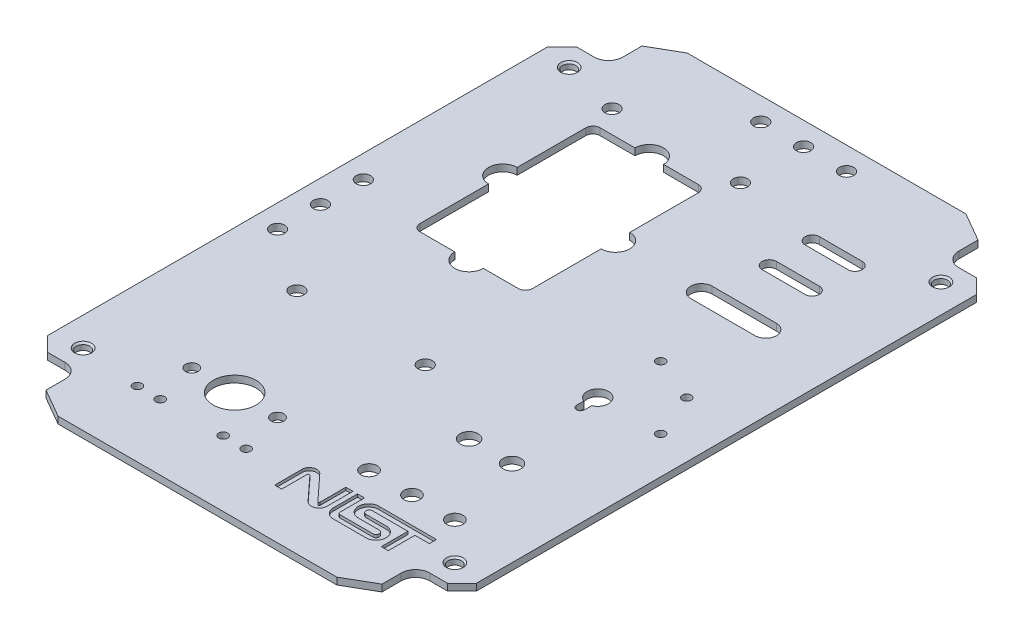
from build123d import *

# Parameters (mm, degrees)
BOSS_EXTRUDE1_DEPTH              = 3.03784
F_15_64_0_23438_DIAMETER_HOLE1_D = 5.9436
LPATTERN1_COUNT                  = 2
LPATTERN1_PITCH                  = 165.1
LPATTERN1_COUNT_DIR2             = 2
LPATTERN1_PITCH_DIR2             = 215.9
FILLET1_R                        = 6.35
F_1_4_0_25_DIAMETER_HOLE2_D      = 6.35
LPATTERN2_COUNT                  = 3
LPATTERN2_PITCH                  = 19.05
F_1_4_0_25_DIAMETER_HOLE3_D      = 6.35
LPATTERN3_COUNT                  = 2
LPATTERN3_PITCH                  = 139.99972
LPATTERN3_COUNT_DIR2             = 2
LPATTERN3_PITCH_DIR2             = 56.999886
CUT_EXTRUDE1_DEPTH               = 170.109080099
CHAMFER1_SIZE                    = 0.762
CHAMFER2_SIZE                    = 6.35
CHAMFER3_SIZE                    = 12.7
CHAMFER3_SIZE2                   = 7.332348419
CHAMFER4_SIZE                    = 12.7
CHAMFER4_SIZE2                   = 7.332348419
F_2_0_221_DIAMETER_HOLE1_D       = 5.6134
LPATTERN4_COUNT                  = 2
LPATTERN4_PITCH                  = 38.1
F_3_4_0_75_DIAMETER_HOLE1_D      = 19.05
K_0_281_DIAMETER_HOLE1_D         = 7.1374
LPATTERN6_COUNT                  = 3
LPATTERN6_PITCH                  = 19.05
CUT_EXTRUDE2_DEPTH               = 170.109080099
F_5_32_0_15625_DIAMETER_HOLE1_D  = 3.96875
CIRPATTERN1_COUNT                = 3
CIRPATTERN1_ANGLE                = 90
CUT_EXTRUDE3_DEPTH               = 3.03784
LPATTERN7_COUNT                  = 2
LPATTERN7_PITCH                  = 19.05
CUT_EXTRUDE4_DEPTH               = 3.03784
F_1_4_0_25_DIAMETER_HOLE6_D      = 6.35
LPATTERN8_COUNT                  = 3
LPATTERN8_PITCH                  = 19.05
FILLET2_R                        = 3.175
F_5_32_0_15625_DIAMETER_HOLE2_D  = 3.96875
LPATTERN9_COUNT                  = 2
LPATTERN9_PITCH                  = 10.16
LPATTERN10_COPY_1_D              = 3.96875
LPATTERN10_COPY_2_D              = 3.96875
O_0_316_DIAMETER_HOLE1_D         = 8.001
LPATTERN11_COUNT                 = 2
LPATTERN11_PITCH                 = 19.05
CUT_EXTRUDE5_DEPTH               = 1.27


with BuildPart() as part:
    # Sketch1 → Boss-Extrude1 (new body)
    with BuildSketch(Plane(origin=(0, 0, 0), x_dir=(1, 0, 0), z_dir=(0, 1, 0))):
        Polygon((-74.6125, 139.7), (74.6125, 139.7), (74.6125, 117.475), (95.25, 117.475), (95.25, -117.475), (74.6125, -117.475), (74.6125, -139.7), (-74.6125, -139.7), (-74.6125, -117.475), (-95.25, -117.475), (-95.25, 117.475), (-74.6125, 117.475), align=None)
    extrude(amount=BOSS_EXTRUDE1_DEPTH)

    # 15_64 _0.23438_ Diameter Hole1 (through all)
    with Locations(Plane(origin=(0, 3.03784, 0), x_dir=(1, 0, 0), z_dir=(0, 1, 0))):
        with Locations((-82.55, -107.95)):
            f_15_64_0_23438_diameter_hole1 = Hole(F_15_64_0_23438_DIAMETER_HOLE1_D / 2)

    # LPattern1: 15_64 _0.23438_ Diameter Hole1 2 × 2
    with Locations(*[(i * LPATTERN1_PITCH, 0, -j * LPATTERN1_PITCH_DIR2) for i in range(LPATTERN1_COUNT) for j in range(LPATTERN1_COUNT_DIR2) if (i, j) != (0, 0)]):
        add(f_15_64_0_23438_diameter_hole1, mode=Mode.SUBTRACT)

    # Fillet1
    fillet1_edges = [part.edges().sort_by_distance(p)[0] for p in [
        (-74.6125, 1.51892, 117.475),
        (-74.6125, 1.51892, -117.475),
        (74.6125, 1.51892, -117.475),
        (74.6125, 1.51892, 117.475),
    ]]
    fillet(fillet1_edges, radius=FILLET1_R)

    # 1_4 _0.25_ Diameter Hole2 (through all)
    with Locations(Plane(origin=(0, 3.03784, 0), x_dir=(1, 0, 0), z_dir=(0, 1, 0))):
        with Locations((-19.05, 129.54)):
            f_1_4_0_25_diameter_hole2 = Hole(F_1_4_0_25_DIAMETER_HOLE2_D / 2)

    # LPattern2: 1_4 _0.25_ Diameter Hole2 ×3
    with Locations(*[(i * LPATTERN2_PITCH, 0, 0) for i in range(1, LPATTERN2_COUNT)]):
        add(f_1_4_0_25_diameter_hole2, mode=Mode.SUBTRACT)

    # 1_4 _0.25_ Diameter Hole3 (through all)
    with Locations(Plane(origin=(0, 3.03784, 0), x_dir=(1, 0, 0), z_dir=(0, 1, 0))):
        with Locations((-57.15, 101.6)):
            f_1_4_0_25_diameter_hole3 = Hole(F_1_4_0_25_DIAMETER_HOLE3_D / 2)

    # LPattern3: 1_4 _0.25_ Diameter Hole3 2 × 2
    with Locations(*[(j * LPATTERN3_PITCH_DIR2, 0, i * LPATTERN3_PITCH) for i in range(LPATTERN3_COUNT) for j in range(LPATTERN3_COUNT_DIR2) if (i, j) != (0, 0)]):
        add(f_1_4_0_25_diameter_hole3, mode=Mode.SUBTRACT)

    # Sketch9 → Cut-Extrude1 (cut, through all)
    with BuildSketch(Plane(origin=(0, 3.03784, 0), x_dir=(1, 0, 0), z_dir=(0, 1, 0))):
        with BuildLine():
            Line((-55.649999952, 91.599999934), (-36.999999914, 91.599999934))
            ThreePointArc((-36.999999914, 91.599999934), (-30.649999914, 97.949999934), (-24.299999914, 91.599999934))
            Line((-24.299999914, 91.599999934), (-5.649999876, 91.599999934))
            Line((-5.649999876, 91.599999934), (-5.649999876, 57.949998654))
            ThreePointArc((-5.649999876, 57.949998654), (0.700000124, 51.599998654), (-5.649999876, 45.249998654))
            Line((-5.649999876, 45.249998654), (-5.649999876, 11.599997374))
            Line((-5.649999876, 11.599997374), (-24.299999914, 11.599997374))
            ThreePointArc((-24.299999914, 11.599997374), (-30.649999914, 5.249997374), (-36.999999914, 11.599997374))
            Line((-36.999999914, 11.599997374), (-55.649999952, 11.599997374))
            Line((-55.649999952, 11.599997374), (-55.649999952, 45.249998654))
            ThreePointArc((-55.649999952, 45.249998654), (-61.999999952, 51.599998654), (-55.649999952, 57.949998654))
            Line((-55.649999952, 57.949998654), (-55.649999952, 91.599999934))
        make_face()
    extrude(amount=-CUT_EXTRUDE1_DEPTH, mode=Mode.SUBTRACT)

    # Chamfer1
    chamfer1_edges = [part.edges().sort_by_distance(p)[0] for p in [
        (-79.5782, 3.03784, 107.95),
        (-79.5782, 3.03784, -107.95),
        (85.5218, 3.03784, 107.95),
        (85.5218, 3.03784, -107.95),
    ]]
    chamfer(chamfer1_edges, length=CHAMFER1_SIZE)

    # Chamfer2
    chamfer2_edges = [part.edges().sort_by_distance(p)[0] for p in [
        (-95.25, 1.51892, 117.475),
        (-95.25, 1.51892, -117.475),
        (95.25, 1.51892, -117.475),
        (95.25, 1.51892, 117.475),
    ]]
    chamfer(chamfer2_edges, length=CHAMFER2_SIZE)

    # Chamfer3
    chamfer3_edges = [part.edges().sort_by_distance(p)[0] for p in [
        (-74.6125, 1.51892, -139.7),
        (74.6125, 1.51892, -139.7),
    ]]
    chamfer3_side = [part.faces().sort_by_distance(p)[0] for p in [
        (0, 1.51892, -139.7),
    ]]
    chamfer(chamfer3_edges, length=CHAMFER3_SIZE, length2=CHAMFER3_SIZE2, reference=chamfer3_side[0])

    # Chamfer4
    chamfer4_edges = [part.edges().sort_by_distance(p)[0] for p in [
        (74.6125, 1.51892, 139.7),
        (-74.6125, 1.51892, 139.7),
    ]]
    chamfer4_side = [part.faces().sort_by_distance(p)[0] for p in [
        (0, 1.51892, 139.7),
    ]]
    chamfer(chamfer4_edges, length=CHAMFER4_SIZE, length2=CHAMFER4_SIZE2, reference=chamfer4_side[0])

    # 2 _0.221_ Diameter Hole1 (through all)
    with Locations(Plane(origin=(0, 3.03784, 0), x_dir=(1, 0, 0), z_dir=(0, 1, 0))):
        with Locations((-50.8, -91.44)):
            f_2_0_221_diameter_hole1 = Hole(F_2_0_221_DIAMETER_HOLE1_D / 2)

    # LPattern4: 2 _0.221_ Diameter Hole1 ×2
    with Locations(*[(i * LPATTERN4_PITCH, 0, 0) for i in range(1, LPATTERN4_COUNT)]):
        add(f_2_0_221_diameter_hole1, mode=Mode.SUBTRACT)

    # 3_4 _0.75_ Diameter Hole1 (through all)
    with Locations(Plane(origin=(0, 3.03784, 0), x_dir=(1, 0, 0), z_dir=(0, 1, 0))):
        with Locations((-31.75, -91.44)):
            Hole(F_3_4_0_75_DIAMETER_HOLE1_D / 2)

    # K _0.281_ Diameter Hole1 (through all)
    with Locations(Plane(origin=(0, 3.03784, 0), x_dir=(1, 0, 0), z_dir=(0, 1, 0))):
        with Locations((27.94, -91.44)):
            k_0_281_diameter_hole1 = Hole(K_0_281_DIAMETER_HOLE1_D / 2)

    # LPattern6: K _0.281_ Diameter Hole1 ×3
    with Locations(*[(i * LPATTERN6_PITCH, 0, 0) for i in range(1, LPATTERN6_COUNT)]):
        add(k_0_281_diameter_hole1, mode=Mode.SUBTRACT)

    # Sketch16 → Cut-Extrude2 (cut, through all)
    with BuildSketch(Plane(origin=(0, 3.03784, 0), x_dir=(1, 0, 0), z_dir=(0, 1, 0))):
        with BuildLine():
            Line((52.578, -17.118158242), (52.578, -20.32))
            ThreePointArc((52.578, -20.32), (50.8, -22.098), (49.022, -20.32))
            Line((49.022, -20.32), (49.022, -17.118158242))
            ThreePointArc((49.022, -17.118158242), (50.8, -7.9375), (52.578, -17.118158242))
        make_face()
    extrude(amount=-CUT_EXTRUDE2_DEPTH, mode=Mode.SUBTRACT)

    # 5_32 _0.15625_ Diameter Hole1 (through all)
    with Locations(Plane(origin=(0, 3.03784, 0), x_dir=(1, 0, 0), z_dir=(0, 1, 0))):
        with Locations((50.8, 15.24)):
            f_5_32_0_15625_diameter_hole1 = Hole(F_5_32_0_15625_DIAMETER_HOLE1_D / 2)

    # CirPattern1: 5_32 _0.15625_ Diameter Hole1 ×3 about axis
    cirpattern1_axis = Axis((50.8, 0, 12.7), (0, -1, 0))
    for i in range(1, CIRPATTERN1_COUNT):
        add(f_5_32_0_15625_diameter_hole1.rotate(cirpattern1_axis, i * CIRPATTERN1_ANGLE / (CIRPATTERN1_COUNT - 1)), mode=Mode.SUBTRACT)

    # Sketch19 → Cut-Extrude3 (cut)
    with BuildSketch(Plane(origin=(0, 3.03784, 0), x_dir=(1, 0, 0), z_dir=(0, 1, 0))):
        with BuildLine():
            Line((57.15, 92.075), (38.1, 92.075))
            ThreePointArc((38.1, 92.075), (34.925, 95.25), (38.1, 98.425))
            Line((38.1, 98.425), (57.15, 98.425))
            ThreePointArc((57.15, 98.425), (60.325, 95.25), (57.15, 92.075))
        make_face()
    cut_extrude3 = extrude(amount=-CUT_EXTRUDE3_DEPTH, mode=Mode.SUBTRACT)

    # LPattern7: Cut-Extrude3 ×2
    with Locations(*[(0, 0, i * LPATTERN7_PITCH) for i in range(1, LPATTERN7_COUNT)]):
        add(cut_extrude3, mode=Mode.SUBTRACT)

    # Sketch20 → Cut-Extrude4 (cut)
    with BuildSketch(Plane(origin=(0, 3.03784, 0), x_dir=(1, 0, 0), z_dir=(0, 1, 0))):
        with BuildLine():
            Line((61.9125, 46.0375), (33.3375, 46.0375))
            ThreePointArc((33.3375, 46.0375), (28.575, 50.8), (33.3375, 55.5625))
            Line((33.3375, 55.5625), (61.9125, 55.5625))
            ThreePointArc((61.9125, 55.5625), (66.675, 50.8), (61.9125, 46.0375))
        make_face()
    extrude(amount=-CUT_EXTRUDE4_DEPTH, mode=Mode.SUBTRACT)

    # 1_4 _0.25_ Diameter Hole6 (through all)
    with Locations(Plane(origin=(0, 3.03784, 0), x_dir=(1, 0, 0), z_dir=(0, 1, 0))):
        with Locations((-85.09, -19.05)):
            f_1_4_0_25_diameter_hole6 = Hole(F_1_4_0_25_DIAMETER_HOLE6_D / 2)

    # LPattern8: 1_4 _0.25_ Diameter Hole6 ×3
    with Locations(*[(0, 0, -i * LPATTERN8_PITCH) for i in range(1, LPATTERN8_COUNT)]):
        add(f_1_4_0_25_diameter_hole6, mode=Mode.SUBTRACT)

    # Fillet2
    fillet2_edges = [part.edges().sort_by_distance(p)[0] for p in [
        (-55.649999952, 1.51892, -91.599999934),
        (-5.649999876, 1.51892, -91.599999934),
        (-5.649999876, 1.51892, -11.599997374),
        (-55.649999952, 1.51892, -11.599997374),
    ]]
    fillet(fillet2_edges, radius=FILLET2_R)

    # 5_32 _0.15625_ Diameter Hole2 (through all)
    with Locations(Plane(origin=(0, 3.03784, 0), x_dir=(1, 0, 0), z_dir=(0, 1, 0))):
        with Locations((-45.72, -110.49)):
            f_5_32_0_15625_diameter_hole2 = Hole(F_5_32_0_15625_DIAMETER_HOLE2_D / 2)

    # LPattern9: 5_32 _0.15625_ Diameter Hole2 ×2
    with Locations(*[(-i * LPATTERN9_PITCH, 0, 0) for i in range(1, LPATTERN9_COUNT)]):
        add(f_5_32_0_15625_diameter_hole2, mode=Mode.SUBTRACT)

    # LPattern10 copy 1 (through all)
    with Locations(Plane(origin=(27.94, 3.03784, 0), x_dir=(1, 0, 0), z_dir=(0, 1, 0))):
        with Locations((-45.72, -110.49)):
            Hole(LPATTERN10_COPY_1_D / 2)

    # LPattern10 copy 2 (through all)
    with Locations(Plane(origin=(38.1, 3.03784, 0), x_dir=(1, 0, 0), z_dir=(0, 1, 0))):
        with Locations((-45.72, -110.49)):
            Hole(LPATTERN10_COPY_2_D / 2)

    # O _0.316_ Diameter Hole1 (through all)
    with Locations(Plane(origin=(0, 3.03784, 0), x_dir=(1, 0, 0), z_dir=(0, 1, 0))):
        with Locations((57.15, -57.15)):
            o_0_316_diameter_hole1 = Hole(O_0_316_DIAMETER_HOLE1_D / 2)

    # LPattern11: O _0.316_ Diameter Hole1 ×2
    with Locations(*[(-i * LPATTERN11_PITCH, 0, 0) for i in range(1, LPATTERN11_COUNT)]):
        add(o_0_316_diameter_hole1, mode=Mode.SUBTRACT)

    # Sketch33 → Cut-Extrude5 (cut)
    with BuildSketch(Plane(origin=(0, 3.03784, 0), x_dir=(1, 0, 0), z_dir=(0, 1, 0))):
        with BuildLine():
            Line((34.4810985, -103.11), (34.4810985, -113.914262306))
            ThreePointArc((34.4810985, -113.914262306), (35.710001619, -116.881096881), (38.676836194, -118.11))
            Line((38.676836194, -118.11), (53.877322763, -118.11))
            ThreePointArc((53.877322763, -118.11), (57.72720584, -113.598535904), (53.877322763, -109.087071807))
            Line((53.877322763, -109.087071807), (44.250561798, -109.087071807))
            ThreePointArc((44.250561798, -109.087071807), (42.84135799, -107.619154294), (44.365544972, -106.271010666))
            Line((44.365544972, -106.271010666), (60.055615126, -106.271010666))
            Line((60.055615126, -106.271010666), (60.055615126, -118.11))
            Line((60.055615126, -118.11), (63.158107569, -118.11))
            Line((63.158107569, -118.11), (63.158107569, -106.271010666))
            Line((63.158107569, -106.271010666), (69.567392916, -106.271010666))
            Line((69.567392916, -106.271010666), (69.567392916, -103.11))
            Line((69.567392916, -103.11), (43.964130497, -103.11))
            ThreePointArc((43.964130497, -103.11), (39.420665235, -107.828807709), (44.308053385, -112.19041978))
            Line((44.308053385, -112.19041978), (53.359898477, -112.19041978))
            ThreePointArc((53.359898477, -112.19041978), (54.653509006, -113.572801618), (53.417390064, -115.006823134))
            Line((53.417390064, -115.006823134), (38.7059242, -115.006823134))
            ThreePointArc((38.7059242, -115.006823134), (37.93336703, -114.686819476), (37.613363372, -113.914262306))
            Line((37.613363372, -113.914262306), (37.613363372, -103.11))
            Line((37.613363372, -103.11), (34.4810985, -103.11))
        make_face()
        with BuildLine():
            Line((12.7, -118.11), (12.7, -105.947908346))
            ThreePointArc((12.7, -105.947908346), (14.772172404, -102.911345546), (18.355185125, -103.733921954))
            Line((18.355185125, -103.733921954), (28.620036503, -114.834348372))
            ThreePointArc((28.620036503, -114.834348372), (29.091658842, -114.93227395), (29.337654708, -114.518144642))
            Line((29.337654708, -114.518144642), (29.337654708, -103.11))
            Line((29.337654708, -103.11), (32.46991958, -103.11))
            Line((32.46991958, -103.11), (32.46991958, -114.592858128))
            ThreePointArc((32.46991958, -114.592858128), (30.1173243, -117.911610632), (26.206812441, -116.790575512))
            Line((26.206812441, -116.790575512), (16.739657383, -106.500977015))
            ThreePointArc((16.739657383, -106.500977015), (16.146183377, -106.363550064), (15.802492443, -106.866515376))
            Line((15.802492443, -106.866515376), (15.802492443, -118.11))
            Line((15.802492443, -118.11), (12.7, -118.11))
        make_face()
    extrude(amount=-CUT_EXTRUDE5_DEPTH, mode=Mode.SUBTRACT)


solid = part.part
